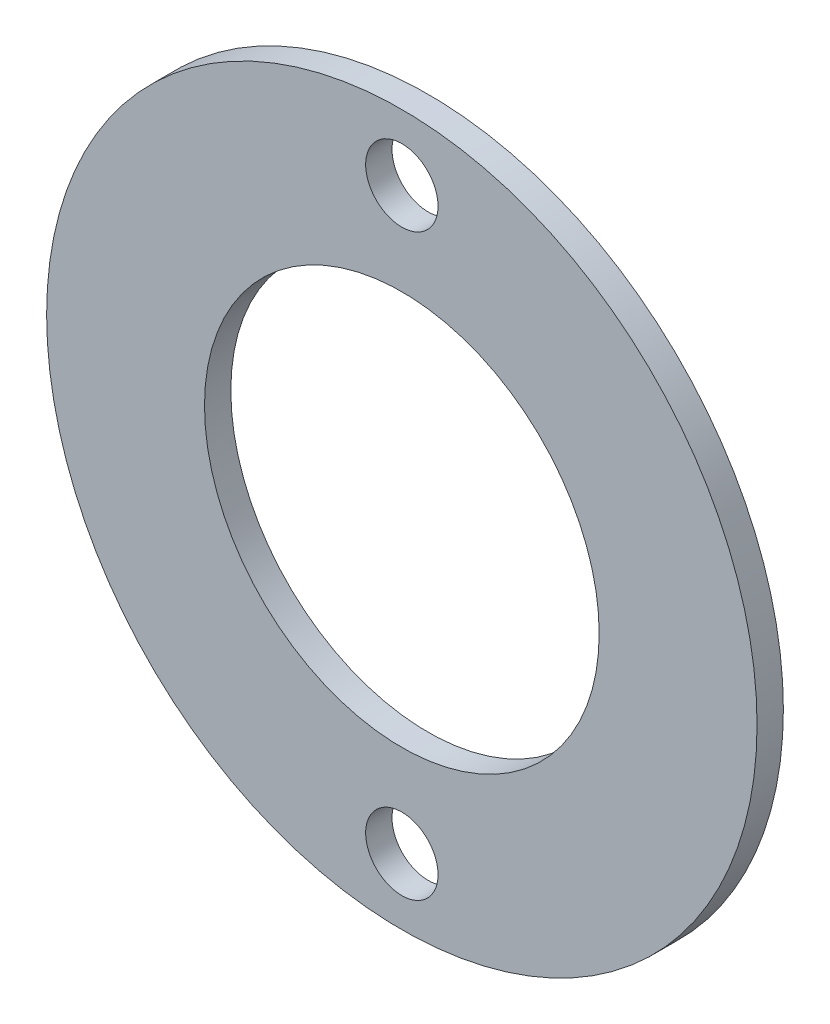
from build123d import *

# Parameters (mm, degrees)
ESQUISSE1_R      = 27
ESQUISSE1_R_2    = 2.75
ESQUISSE1_R_3    = 15
EXTRUSION1_DEPTH = 2


with BuildPart() as part:
    # Esquisse1 → Extrusion1 (new body)
    with BuildSketch(Plane.XY):
        Circle(ESQUISSE1_R)
        with Locations((0, 22)):
            Circle(ESQUISSE1_R_2, mode=Mode.SUBTRACT)
        with Locations((0, -22)):
            Circle(ESQUISSE1_R_2, mode=Mode.SUBTRACT)
        Circle(ESQUISSE1_R_3, mode=Mode.SUBTRACT)
    extrude(amount=EXTRUSION1_DEPTH)


solid = part.part
